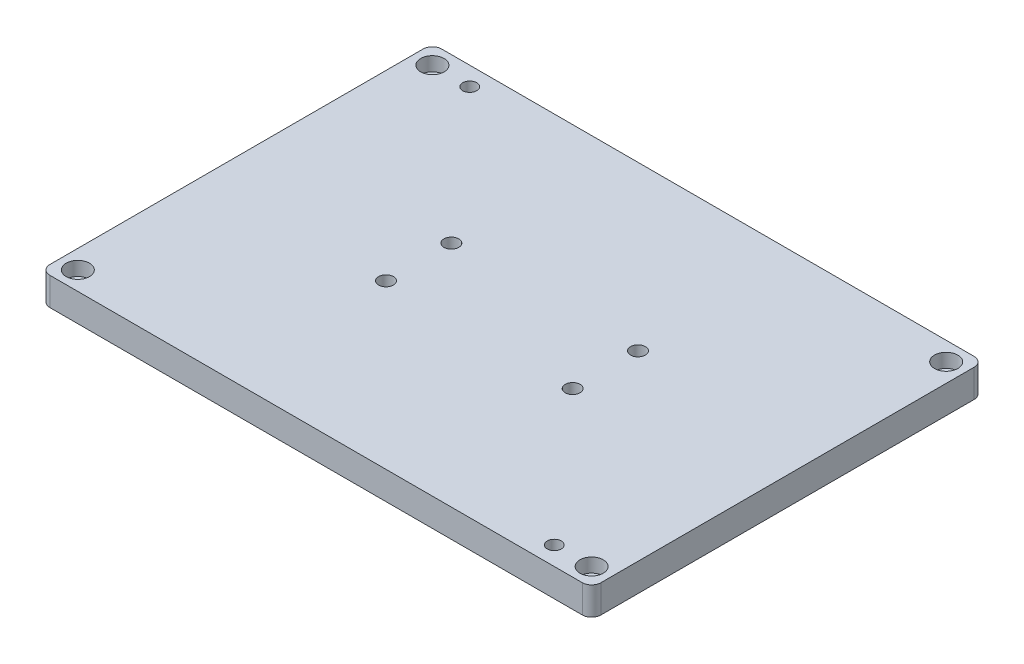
ISO-10303-21;
HEADER;
FILE_DESCRIPTION(('STEP AP214'),'2;1');
FILE_NAME('part.step','',(''),(''),'','','');
FILE_SCHEMA(('AUTOMOTIVE_DESIGN { 1 0 10303 214 1 1 1 1 }'));
ENDSEC;
DATA;
#1=APPLICATION_CONTEXT('core data for automotive mechanical design processes');
#2=APPLICATION_PROTOCOL_DEFINITION('international standard','automotive_design',2000,#1);
#3=PRODUCT_CONTEXT('',#1,'mechanical');
#4=PRODUCT('Part','Part','',(#3));
#5=PRODUCT_RELATED_PRODUCT_CATEGORY('part','',(#4));
#6=PRODUCT_DEFINITION_FORMATION('','',#4);
#7=PRODUCT_DEFINITION_CONTEXT('part definition',#1,'design');
#8=PRODUCT_DEFINITION('design','',#6,#7);
#9=PRODUCT_DEFINITION_SHAPE('','',#8);
#10=(LENGTH_UNIT() NAMED_UNIT(*) SI_UNIT(.MILLI.,.METRE.));
#11=(NAMED_UNIT(*) PLANE_ANGLE_UNIT() SI_UNIT($,.RADIAN.));
#12=(NAMED_UNIT(*) SI_UNIT($,.STERADIAN.) SOLID_ANGLE_UNIT());
#13=UNCERTAINTY_MEASURE_WITH_UNIT(LENGTH_MEASURE(1.E-05),#10,'distance_accuracy_value','');
#14=(GEOMETRIC_REPRESENTATION_CONTEXT(3) GLOBAL_UNCERTAINTY_ASSIGNED_CONTEXT((#13)) GLOBAL_UNIT_ASSIGNED_CONTEXT((#10,
#11,#12)) REPRESENTATION_CONTEXT('',''));
#15=CARTESIAN_POINT('',(0.,0.,0.));
#16=DIRECTION('',(0.,0.,1.));
#17=DIRECTION('',(1.,0.,0.));
#18=AXIS2_PLACEMENT_3D('',#15,#16,#17);
#19=CARTESIAN_POINT('',(0.,0.,0.));
#20=DIRECTION('',(0.,1.,0.));
#21=DIRECTION('',(0.,0.,1.));
#22=AXIS2_PLACEMENT_3D('',#19,#20,#21);
#23=PLANE('',#22);
#24=CARTESIAN_POINT('',(-63.5,0.,22.225));
#25=DIRECTION('',(0.,-1.,0.));
#26=DIRECTION('',(0.,0.,-1.));
#27=AXIS2_PLACEMENT_3D('',#24,#25,#26);
#28=CIRCLE('',#27,7.9375);
#29=CARTESIAN_POINT('',(-63.5,0.,14.2875));
#30=VERTEX_POINT('',#29);
#31=EDGE_CURVE('E287',#30,#30,#28,.T.);
#32=ORIENTED_EDGE('',*,*,#31,.F.);
#33=EDGE_LOOP('',(#32));
#34=FACE_BOUND('',#33,.T.);
#35=CARTESIAN_POINT('',(-63.5,0.,-22.225));
#36=DIRECTION('',(0.,-1.,0.));
#37=DIRECTION('',(0.,0.,-1.));
#38=AXIS2_PLACEMENT_3D('',#35,#36,#37);
#39=CIRCLE('',#38,7.9375);
#40=CARTESIAN_POINT('',(-63.5,0.,-30.1625));
#41=VERTEX_POINT('',#40);
#42=EDGE_CURVE('E275',#41,#41,#39,.T.);
#43=ORIENTED_EDGE('',*,*,#42,.F.);
#44=EDGE_LOOP('',(#43));
#45=FACE_BOUND('',#44,.T.);
#46=CARTESIAN_POINT('',(149.4234375,0.,120.65));
#47=DIRECTION('',(0.,1.,0.));
#48=DIRECTION('',(0.,0.,1.));
#49=AXIS2_PLACEMENT_3D('',#46,#47,#48);
#50=CIRCLE('',#49,4.7625);
#51=CARTESIAN_POINT('',(149.4234375,0.,125.4125));
#52=VERTEX_POINT('',#51);
#53=EDGE_CURVE('E236',#52,#52,#50,.T.);
#54=ORIENTED_EDGE('',*,*,#53,.T.);
#55=EDGE_LOOP('',(#54));
#56=FACE_BOUND('',#55,.T.);
#57=CARTESIAN_POINT('',(-149.4234375,0.,-120.65));
#58=DIRECTION('',(0.,1.,0.));
#59=DIRECTION('',(0.,0.,1.));
#60=AXIS2_PLACEMENT_3D('',#57,#58,#59);
#61=CIRCLE('',#60,4.7625);
#62=CARTESIAN_POINT('',(-149.4234375,0.,-115.8875));
#63=VERTEX_POINT('',#62);
#64=EDGE_CURVE('E230',#63,#63,#61,.T.);
#65=ORIENTED_EDGE('',*,*,#64,.T.);
#66=EDGE_LOOP('',(#65));
#67=FACE_BOUND('',#66,.T.);
#68=CARTESIAN_POINT('',(174.8234375,0.,120.65));
#69=DIRECTION('',(0.,1.,0.));
#70=DIRECTION('',(0.,0.,1.));
#71=AXIS2_PLACEMENT_3D('',#68,#69,#70);
#72=CIRCLE('',#71,5.04189999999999);
#73=CARTESIAN_POINT('',(174.8234375,0.,125.6919));
#74=VERTEX_POINT('',#73);
#75=EDGE_CURVE('E218',#74,#74,#72,.T.);
#76=ORIENTED_EDGE('',*,*,#75,.T.);
#77=EDGE_LOOP('',(#76));
#78=FACE_BOUND('',#77,.T.);
#79=CARTESIAN_POINT('',(174.8234375,0.,-120.65));
#80=DIRECTION('',(0.,1.,0.));
#81=DIRECTION('',(0.,0.,1.));
#82=AXIS2_PLACEMENT_3D('',#79,#80,#81);
#83=CIRCLE('',#82,5.04189999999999);
#84=CARTESIAN_POINT('',(174.8234375,0.,-115.6081));
#85=VERTEX_POINT('',#84);
#86=EDGE_CURVE('E206',#85,#85,#83,.T.);
#87=ORIENTED_EDGE('',*,*,#86,.T.);
#88=EDGE_LOOP('',(#87));
#89=FACE_BOUND('',#88,.T.);
#90=CARTESIAN_POINT('',(-174.8234375,0.,120.65));
#91=DIRECTION('',(0.,1.,0.));
#92=DIRECTION('',(0.,0.,1.));
#93=AXIS2_PLACEMENT_3D('',#90,#91,#92);
#94=CIRCLE('',#93,5.04189999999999);
#95=CARTESIAN_POINT('',(-174.8234375,0.,125.6919));
#96=VERTEX_POINT('',#95);
#97=EDGE_CURVE('E194',#96,#96,#94,.T.);
#98=ORIENTED_EDGE('',*,*,#97,.T.);
#99=EDGE_LOOP('',(#98));
#100=FACE_BOUND('',#99,.T.);
#101=CARTESIAN_POINT('',(-174.8234375,0.,-120.65));
#102=DIRECTION('',(0.,1.,0.));
#103=DIRECTION('',(0.,0.,1.));
#104=AXIS2_PLACEMENT_3D('',#101,#102,#103);
#105=CIRCLE('',#104,5.04189999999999);
#106=CARTESIAN_POINT('',(-174.8234375,0.,-115.6081));
#107=VERTEX_POINT('',#106);
#108=EDGE_CURVE('E129',#107,#107,#105,.T.);
#109=ORIENTED_EDGE('',*,*,#108,.T.);
#110=EDGE_LOOP('',(#109));
#111=FACE_BOUND('',#110,.T.);
#112=DIRECTION('',(0.,0.,-1.));
#113=VECTOR('',#112,1.);
#114=CARTESIAN_POINT('',(187.5234375,0.,-133.35));
#115=LINE('',#114,#113);
#116=CARTESIAN_POINT('',(187.5234375,0.,127.));
#117=VERTEX_POINT('',#116);
#118=CARTESIAN_POINT('',(187.5234375,0.,-127.));
#119=VERTEX_POINT('',#118);
#120=EDGE_CURVE('E118',#117,#119,#115,.T.);
#121=ORIENTED_EDGE('',*,*,#120,.F.);
#122=CARTESIAN_POINT('',(181.1734375,0.,127.));
#123=DIRECTION('',(0.,1.,0.));
#124=DIRECTION('',(0.,0.,1.));
#125=AXIS2_PLACEMENT_3D('',#122,#123,#124);
#126=CIRCLE('',#125,6.35);
#127=CARTESIAN_POINT('',(181.1734375,0.,133.35));
#128=VERTEX_POINT('',#127);
#129=EDGE_CURVE('E101',#117,#128,#126,.F.);
#130=ORIENTED_EDGE('',*,*,#129,.T.);
#131=DIRECTION('',(1.,0.,0.));
#132=VECTOR('',#131,1.);
#133=CARTESIAN_POINT('',(-187.5234375,0.,133.35));
#134=LINE('',#133,#132);
#135=CARTESIAN_POINT('',(-181.1734375,0.,133.35));
#136=VERTEX_POINT('',#135);
#137=EDGE_CURVE('E142',#136,#128,#134,.T.);
#138=ORIENTED_EDGE('',*,*,#137,.F.);
#139=CARTESIAN_POINT('',(-181.1734375,0.,127.));
#140=DIRECTION('',(0.,1.,0.));
#141=DIRECTION('',(0.,0.,1.));
#142=AXIS2_PLACEMENT_3D('',#139,#140,#141);
#143=CIRCLE('',#142,6.35);
#144=CARTESIAN_POINT('',(-187.5234375,0.,127.));
#145=VERTEX_POINT('',#144);
#146=EDGE_CURVE('E112',#136,#145,#143,.F.);
#147=ORIENTED_EDGE('',*,*,#146,.T.);
#148=DIRECTION('',(0.,0.,1.));
#149=VECTOR('',#148,1.);
#150=CARTESIAN_POINT('',(-187.5234375,0.,-133.35));
#151=LINE('',#150,#149);
#152=CARTESIAN_POINT('',(-187.5234375,0.,-127.));
#153=VERTEX_POINT('',#152);
#154=EDGE_CURVE('E132',#153,#145,#151,.T.);
#155=ORIENTED_EDGE('',*,*,#154,.F.);
#156=CARTESIAN_POINT('',(-181.1734375,0.,-127.));
#157=DIRECTION('',(0.,1.,0.));
#158=DIRECTION('',(0.,0.,1.));
#159=AXIS2_PLACEMENT_3D('',#156,#157,#158);
#160=CIRCLE('',#159,6.35);
#161=CARTESIAN_POINT('',(-181.1734375,0.,-133.35));
#162=VERTEX_POINT('',#161);
#163=EDGE_CURVE('E122',#153,#162,#160,.F.);
#164=ORIENTED_EDGE('',*,*,#163,.T.);
#165=DIRECTION('',(-1.,0.,0.));
#166=VECTOR('',#165,1.);
#167=CARTESIAN_POINT('',(-187.5234375,0.,-133.35));
#168=LINE('',#167,#166);
#169=CARTESIAN_POINT('',(181.1734375,0.,-133.35));
#170=VERTEX_POINT('',#169);
#171=EDGE_CURVE('E128',#170,#162,#168,.T.);
#172=ORIENTED_EDGE('',*,*,#171,.F.);
#173=CARTESIAN_POINT('',(181.1734375,0.,-127.));
#174=DIRECTION('',(0.,1.,0.));
#175=DIRECTION('',(0.,0.,1.));
#176=AXIS2_PLACEMENT_3D('',#173,#174,#175);
#177=CIRCLE('',#176,6.35);
#178=EDGE_CURVE('E127',#170,#119,#177,.F.);
#179=ORIENTED_EDGE('',*,*,#178,.T.);
#180=EDGE_LOOP('',(#121,#130,#138,#147,#155,#164,#172,#179));
#181=FACE_BOUND('',#180,.T.);
#182=CARTESIAN_POINT('',(63.5,0.,-22.225));
#183=DIRECTION('',(0.,-1.,0.));
#184=DIRECTION('',(0.,0.,-1.));
#185=AXIS2_PLACEMENT_3D('',#182,#183,#184);
#186=CIRCLE('',#185,7.9375);
#187=CARTESIAN_POINT('',(63.5,0.,-30.1625));
#188=VERTEX_POINT('',#187);
#189=EDGE_CURVE('E251',#188,#188,#186,.T.);
#190=ORIENTED_EDGE('',*,*,#189,.F.);
#191=EDGE_LOOP('',(#190));
#192=FACE_BOUND('',#191,.T.);
#193=CARTESIAN_POINT('',(63.5,0.,22.225));
#194=DIRECTION('',(0.,-1.,0.));
#195=DIRECTION('',(0.,0.,-1.));
#196=AXIS2_PLACEMENT_3D('',#193,#194,#195);
#197=CIRCLE('',#196,7.9375);
#198=CARTESIAN_POINT('',(63.5,0.,14.2875));
#199=VERTEX_POINT('',#198);
#200=EDGE_CURVE('E263',#199,#199,#197,.T.);
#201=ORIENTED_EDGE('',*,*,#200,.F.);
#202=EDGE_LOOP('',(#201));
#203=FACE_BOUND('',#202,.T.);
#204=ADVANCED_FACE('F34',(#34,#45,#56,#67,#78,#89,#100,#111,#181,#192,#203),#23,.F.);
#205=CARTESIAN_POINT('',(0.,19.05,0.));
#206=DIRECTION('',(0.,1.,0.));
#207=DIRECTION('',(0.,0.,1.));
#208=AXIS2_PLACEMENT_3D('',#205,#206,#207);
#209=PLANE('',#208);
#210=CARTESIAN_POINT('',(-63.5,19.05,22.225));
#211=DIRECTION('',(0.,-1.,0.));
#212=DIRECTION('',(0.,0.,-1.));
#213=AXIS2_PLACEMENT_3D('',#210,#211,#212);
#214=CIRCLE('',#213,5.04189999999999);
#215=CARTESIAN_POINT('',(-63.5,19.05,17.1831));
#216=VERTEX_POINT('',#215);
#217=EDGE_CURVE('E278',#216,#216,#214,.T.);
#218=ORIENTED_EDGE('',*,*,#217,.T.);
#219=EDGE_LOOP('',(#218));
#220=FACE_BOUND('',#219,.T.);
#221=CARTESIAN_POINT('',(-63.5,19.05,-22.225));
#222=DIRECTION('',(0.,-1.,0.));
#223=DIRECTION('',(0.,0.,-1.));
#224=AXIS2_PLACEMENT_3D('',#221,#222,#223);
#225=CIRCLE('',#224,5.04189999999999);
#226=CARTESIAN_POINT('',(-63.5,19.05,-27.2669));
#227=VERTEX_POINT('',#226);
#228=EDGE_CURVE('E266',#227,#227,#225,.T.);
#229=ORIENTED_EDGE('',*,*,#228,.T.);
#230=EDGE_LOOP('',(#229));
#231=FACE_BOUND('',#230,.T.);
#232=CARTESIAN_POINT('',(63.5,19.05,22.225));
#233=DIRECTION('',(0.,-1.,0.));
#234=DIRECTION('',(0.,0.,-1.));
#235=AXIS2_PLACEMENT_3D('',#232,#233,#234);
#236=CIRCLE('',#235,5.0419);
#237=CARTESIAN_POINT('',(63.5,19.05,17.1831));
#238=VERTEX_POINT('',#237);
#239=EDGE_CURVE('E254',#238,#238,#236,.T.);
#240=ORIENTED_EDGE('',*,*,#239,.T.);
#241=EDGE_LOOP('',(#240));
#242=FACE_BOUND('',#241,.T.);
#243=DIRECTION('',(1.,0.,0.));
#244=VECTOR('',#243,1.);
#245=CARTESIAN_POINT('',(-187.5234375,19.05,133.35));
#246=LINE('',#245,#244);
#247=CARTESIAN_POINT('',(-181.1734375,19.05,133.35));
#248=VERTEX_POINT('',#247);
#249=CARTESIAN_POINT('',(181.1734375,19.05,133.35));
#250=VERTEX_POINT('',#249);
#251=EDGE_CURVE('E138',#248,#250,#246,.T.);
#252=ORIENTED_EDGE('',*,*,#251,.T.);
#253=CARTESIAN_POINT('',(181.1734375,19.05,127.));
#254=DIRECTION('',(0.,1.,0.));
#255=DIRECTION('',(0.,0.,1.));
#256=AXIS2_PLACEMENT_3D('',#253,#254,#255);
#257=CIRCLE('',#256,6.35);
#258=CARTESIAN_POINT('',(187.5234375,19.05,127.));
#259=VERTEX_POINT('',#258);
#260=EDGE_CURVE('E156',#250,#259,#257,.T.);
#261=ORIENTED_EDGE('',*,*,#260,.T.);
#262=DIRECTION('',(0.,0.,-1.));
#263=VECTOR('',#262,1.);
#264=CARTESIAN_POINT('',(187.5234375,19.05,-133.35));
#265=LINE('',#264,#263);
#266=CARTESIAN_POINT('',(187.5234375,19.05,-127.));
#267=VERTEX_POINT('',#266);
#268=EDGE_CURVE('E121',#259,#267,#265,.T.);
#269=ORIENTED_EDGE('',*,*,#268,.T.);
#270=CARTESIAN_POINT('',(181.1734375,19.05,-127.));
#271=DIRECTION('',(0.,1.,0.));
#272=DIRECTION('',(0.,0.,1.));
#273=AXIS2_PLACEMENT_3D('',#270,#271,#272);
#274=CIRCLE('',#273,6.35);
#275=CARTESIAN_POINT('',(181.1734375,19.05,-133.35));
#276=VERTEX_POINT('',#275);
#277=EDGE_CURVE('E152',#267,#276,#274,.T.);
#278=ORIENTED_EDGE('',*,*,#277,.T.);
#279=DIRECTION('',(-1.,0.,0.));
#280=VECTOR('',#279,1.);
#281=CARTESIAN_POINT('',(-187.5234375,19.05,-133.35));
#282=LINE('',#281,#280);
#283=CARTESIAN_POINT('',(-181.1734375,19.05,-133.35));
#284=VERTEX_POINT('',#283);
#285=EDGE_CURVE('E165',#276,#284,#282,.T.);
#286=ORIENTED_EDGE('',*,*,#285,.T.);
#287=CARTESIAN_POINT('',(-181.1734375,19.05,-127.));
#288=DIRECTION('',(0.,1.,0.));
#289=DIRECTION('',(0.,0.,1.));
#290=AXIS2_PLACEMENT_3D('',#287,#288,#289);
#291=CIRCLE('',#290,6.35);
#292=CARTESIAN_POINT('',(-187.5234375,19.05,-127.));
#293=VERTEX_POINT('',#292);
#294=EDGE_CURVE('E56',#284,#293,#291,.T.);
#295=ORIENTED_EDGE('',*,*,#294,.T.);
#296=DIRECTION('',(0.,0.,1.));
#297=VECTOR('',#296,1.);
#298=CARTESIAN_POINT('',(-187.5234375,19.05,-133.35));
#299=LINE('',#298,#297);
#300=CARTESIAN_POINT('',(-187.5234375,19.05,127.));
#301=VERTEX_POINT('',#300);
#302=EDGE_CURVE('E172',#293,#301,#299,.T.);
#303=ORIENTED_EDGE('',*,*,#302,.T.);
#304=CARTESIAN_POINT('',(-181.1734375,19.05,127.));
#305=DIRECTION('',(0.,1.,0.));
#306=DIRECTION('',(0.,0.,1.));
#307=AXIS2_PLACEMENT_3D('',#304,#305,#306);
#308=CIRCLE('',#307,6.35);
#309=EDGE_CURVE('E154',#301,#248,#308,.T.);
#310=ORIENTED_EDGE('',*,*,#309,.T.);
#311=EDGE_LOOP('',(#252,#261,#269,#278,#286,#295,#303,#310));
#312=FACE_BOUND('',#311,.T.);
#313=CARTESIAN_POINT('',(-174.8234375,19.05,-120.65));
#314=DIRECTION('',(0.,1.,0.));
#315=DIRECTION('',(0.,0.,1.));
#316=AXIS2_PLACEMENT_3D('',#313,#314,#315);
#317=CIRCLE('',#316,7.93749999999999);
#318=CARTESIAN_POINT('',(-174.8234375,19.05,-112.7125));
#319=VERTEX_POINT('',#318);
#320=EDGE_CURVE('E191',#319,#319,#317,.T.);
#321=ORIENTED_EDGE('',*,*,#320,.F.);
#322=EDGE_LOOP('',(#321));
#323=FACE_BOUND('',#322,.T.);
#324=CARTESIAN_POINT('',(-174.8234375,19.05,120.65));
#325=DIRECTION('',(0.,1.,0.));
#326=DIRECTION('',(0.,0.,1.));
#327=AXIS2_PLACEMENT_3D('',#324,#325,#326);
#328=CIRCLE('',#327,7.93749999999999);
#329=CARTESIAN_POINT('',(-174.8234375,19.05,128.5875));
#330=VERTEX_POINT('',#329);
#331=EDGE_CURVE('E203',#330,#330,#328,.T.);
#332=ORIENTED_EDGE('',*,*,#331,.F.);
#333=EDGE_LOOP('',(#332));
#334=FACE_BOUND('',#333,.T.);
#335=CARTESIAN_POINT('',(174.8234375,19.05,-120.65));
#336=DIRECTION('',(0.,1.,0.));
#337=DIRECTION('',(0.,0.,1.));
#338=AXIS2_PLACEMENT_3D('',#335,#336,#337);
#339=CIRCLE('',#338,7.93749999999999);
#340=CARTESIAN_POINT('',(174.8234375,19.05,-112.7125));
#341=VERTEX_POINT('',#340);
#342=EDGE_CURVE('E215',#341,#341,#339,.T.);
#343=ORIENTED_EDGE('',*,*,#342,.F.);
#344=EDGE_LOOP('',(#343));
#345=FACE_BOUND('',#344,.T.);
#346=CARTESIAN_POINT('',(174.8234375,19.05,120.65));
#347=DIRECTION('',(0.,1.,0.));
#348=DIRECTION('',(0.,0.,1.));
#349=AXIS2_PLACEMENT_3D('',#346,#347,#348);
#350=CIRCLE('',#349,7.93749999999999);
#351=CARTESIAN_POINT('',(174.8234375,19.05,128.5875));
#352=VERTEX_POINT('',#351);
#353=EDGE_CURVE('E227',#352,#352,#350,.T.);
#354=ORIENTED_EDGE('',*,*,#353,.F.);
#355=EDGE_LOOP('',(#354));
#356=FACE_BOUND('',#355,.T.);
#357=CARTESIAN_POINT('',(-149.4234375,19.05,-120.65));
#358=DIRECTION('',(0.,1.,0.));
#359=DIRECTION('',(0.,0.,1.));
#360=AXIS2_PLACEMENT_3D('',#357,#358,#359);
#361=CIRCLE('',#360,4.7625);
#362=CARTESIAN_POINT('',(-149.4234375,19.05,-115.8875));
#363=VERTEX_POINT('',#362);
#364=EDGE_CURVE('E233',#363,#363,#361,.T.);
#365=ORIENTED_EDGE('',*,*,#364,.F.);
#366=EDGE_LOOP('',(#365));
#367=FACE_BOUND('',#366,.T.);
#368=CARTESIAN_POINT('',(149.4234375,19.05,120.65));
#369=DIRECTION('',(0.,1.,0.));
#370=DIRECTION('',(0.,0.,1.));
#371=AXIS2_PLACEMENT_3D('',#368,#369,#370);
#372=CIRCLE('',#371,4.7625);
#373=CARTESIAN_POINT('',(149.4234375,19.05,125.4125));
#374=VERTEX_POINT('',#373);
#375=EDGE_CURVE('E239',#374,#374,#372,.T.);
#376=ORIENTED_EDGE('',*,*,#375,.F.);
#377=EDGE_LOOP('',(#376));
#378=FACE_BOUND('',#377,.T.);
#379=CARTESIAN_POINT('',(63.5,19.05,-22.225));
#380=DIRECTION('',(0.,-1.,0.));
#381=DIRECTION('',(0.,0.,-1.));
#382=AXIS2_PLACEMENT_3D('',#379,#380,#381);
#383=CIRCLE('',#382,5.0419);
#384=CARTESIAN_POINT('',(63.5,19.05,-27.2669));
#385=VERTEX_POINT('',#384);
#386=EDGE_CURVE('E242',#385,#385,#383,.T.);
#387=ORIENTED_EDGE('',*,*,#386,.T.);
#388=EDGE_LOOP('',(#387));
#389=FACE_BOUND('',#388,.T.);
#390=ADVANCED_FACE('F169',(#220,#231,#242,#312,#323,#334,#345,#356,#367,#378,#389),#209,.T.);
#391=CARTESIAN_POINT('',(187.5234375,19.05,-133.35));
#392=DIRECTION('',(-1.,0.,0.));
#393=DIRECTION('',(0.,0.,1.));
#394=AXIS2_PLACEMENT_3D('',#391,#392,#393);
#395=PLANE('',#394);
#396=ORIENTED_EDGE('',*,*,#268,.F.);
#397=DIRECTION('',(0.,-1.,0.));
#398=VECTOR('',#397,1.);
#399=CARTESIAN_POINT('',(187.5234375,19.05,127.));
#400=LINE('',#399,#398);
#401=EDGE_CURVE('E105',#259,#117,#400,.T.);
#402=ORIENTED_EDGE('',*,*,#401,.T.);
#403=ORIENTED_EDGE('',*,*,#120,.T.);
#404=DIRECTION('',(0.,-1.,0.));
#405=VECTOR('',#404,1.);
#406=CARTESIAN_POINT('',(187.5234375,19.05,-127.));
#407=LINE('',#406,#405);
#408=EDGE_CURVE('E123',#119,#267,#407,.F.);
#409=ORIENTED_EDGE('',*,*,#408,.T.);
#410=EDGE_LOOP('',(#396,#402,#403,#409));
#411=FACE_BOUND('',#410,.T.);
#412=ADVANCED_FACE('F117',(#411),#395,.F.);
#413=CARTESIAN_POINT('',(-187.5234375,19.05,-133.35));
#414=DIRECTION('',(0.,0.,1.));
#415=DIRECTION('',(1.,0.,0.));
#416=AXIS2_PLACEMENT_3D('',#413,#414,#415);
#417=PLANE('',#416);
#418=ORIENTED_EDGE('',*,*,#285,.F.);
#419=DIRECTION('',(0.,-1.,0.));
#420=VECTOR('',#419,1.);
#421=CARTESIAN_POINT('',(181.1734375,19.05,-133.35));
#422=LINE('',#421,#420);
#423=EDGE_CURVE('E11',#276,#170,#422,.T.);
#424=ORIENTED_EDGE('',*,*,#423,.T.);
#425=ORIENTED_EDGE('',*,*,#171,.T.);
#426=DIRECTION('',(0.,-1.,0.));
#427=VECTOR('',#426,1.);
#428=CARTESIAN_POINT('',(-181.1734375,19.05,-133.35));
#429=LINE('',#428,#427);
#430=EDGE_CURVE('E42',#162,#284,#429,.F.);
#431=ORIENTED_EDGE('',*,*,#430,.T.);
#432=EDGE_LOOP('',(#418,#424,#425,#431));
#433=FACE_BOUND('',#432,.T.);
#434=ADVANCED_FACE('F164',(#433),#417,.F.);
#435=CARTESIAN_POINT('',(-187.5234375,19.05,-133.35));
#436=DIRECTION('',(1.,0.,0.));
#437=DIRECTION('',(0.,0.,-1.));
#438=AXIS2_PLACEMENT_3D('',#435,#436,#437);
#439=PLANE('',#438);
#440=ORIENTED_EDGE('',*,*,#154,.T.);
#441=DIRECTION('',(0.,-1.,0.));
#442=VECTOR('',#441,1.);
#443=CARTESIAN_POINT('',(-187.5234375,19.05,127.));
#444=LINE('',#443,#442);
#445=EDGE_CURVE('E49',#145,#301,#444,.F.);
#446=ORIENTED_EDGE('',*,*,#445,.T.);
#447=ORIENTED_EDGE('',*,*,#302,.F.);
#448=DIRECTION('',(0.,-1.,0.));
#449=VECTOR('',#448,1.);
#450=CARTESIAN_POINT('',(-187.5234375,19.05,-127.));
#451=LINE('',#450,#449);
#452=EDGE_CURVE('E158',#293,#153,#451,.T.);
#453=ORIENTED_EDGE('',*,*,#452,.T.);
#454=EDGE_LOOP('',(#440,#446,#447,#453));
#455=FACE_BOUND('',#454,.T.);
#456=ADVANCED_FACE('F176',(#455),#439,.F.);
#457=CARTESIAN_POINT('',(-187.5234375,19.05,133.35));
#458=DIRECTION('',(0.,0.,-1.));
#459=DIRECTION('',(-1.,0.,0.));
#460=AXIS2_PLACEMENT_3D('',#457,#458,#459);
#461=PLANE('',#460);
#462=ORIENTED_EDGE('',*,*,#137,.T.);
#463=DIRECTION('',(0.,-1.,0.));
#464=VECTOR('',#463,1.);
#465=CARTESIAN_POINT('',(181.1734375,19.05,133.35));
#466=LINE('',#465,#464);
#467=EDGE_CURVE('E106',#128,#250,#466,.F.);
#468=ORIENTED_EDGE('',*,*,#467,.T.);
#469=ORIENTED_EDGE('',*,*,#251,.F.);
#470=DIRECTION('',(0.,-1.,0.));
#471=VECTOR('',#470,1.);
#472=CARTESIAN_POINT('',(-181.1734375,19.05,133.35));
#473=LINE('',#472,#471);
#474=EDGE_CURVE('E111',#248,#136,#473,.T.);
#475=ORIENTED_EDGE('',*,*,#474,.T.);
#476=EDGE_LOOP('',(#462,#468,#469,#475));
#477=FACE_BOUND('',#476,.T.);
#478=ADVANCED_FACE('F183',(#477),#461,.F.);
#479=CARTESIAN_POINT('',(-174.8234375,19.05,-120.65));
#480=DIRECTION('',(0.,1.,0.));
#481=DIRECTION('',(0.,0.,1.));
#482=AXIS2_PLACEMENT_3D('',#479,#480,#481);
#483=CYLINDRICAL_SURFACE('',#482,5.04189999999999);
#484=ORIENTED_EDGE('',*,*,#108,.F.);
#485=EDGE_LOOP('',(#484));
#486=FACE_BOUND('',#485,.T.);
#487=CARTESIAN_POINT('',(-174.8234375,9.525,-120.65));
#488=DIRECTION('',(0.,1.,0.));
#489=DIRECTION('',(0.,0.,1.));
#490=AXIS2_PLACEMENT_3D('',#487,#488,#489);
#491=CIRCLE('',#490,5.04189999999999);
#492=CARTESIAN_POINT('',(-174.8234375,9.525,-115.6081));
#493=VERTEX_POINT('',#492);
#494=EDGE_CURVE('E135',#493,#493,#491,.T.);
#495=ORIENTED_EDGE('',*,*,#494,.T.);
#496=EDGE_LOOP('',(#495));
#497=FACE_BOUND('',#496,.T.);
#498=ADVANCED_FACE('F310',(#486,#497),#483,.F.);
#499=CARTESIAN_POINT('',(-169.7815375,9.525,-120.65));
#500=DIRECTION('',(0.,-1.,0.));
#501=DIRECTION('',(0.,0.,-1.));
#502=AXIS2_PLACEMENT_3D('',#499,#500,#501);
#503=PLANE('',#502);
#504=ORIENTED_EDGE('',*,*,#494,.F.);
#505=EDGE_LOOP('',(#504));
#506=FACE_BOUND('',#505,.T.);
#507=CARTESIAN_POINT('',(-174.8234375,9.525,-120.65));
#508=DIRECTION('',(0.,1.,0.));
#509=DIRECTION('',(0.,0.,1.));
#510=AXIS2_PLACEMENT_3D('',#507,#508,#509);
#511=CIRCLE('',#510,7.93749999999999);
#512=CARTESIAN_POINT('',(-174.8234375,9.525,-112.7125));
#513=VERTEX_POINT('',#512);
#514=EDGE_CURVE('E188',#513,#513,#511,.T.);
#515=ORIENTED_EDGE('',*,*,#514,.T.);
#516=EDGE_LOOP('',(#515));
#517=FACE_BOUND('',#516,.T.);
#518=ADVANCED_FACE('F313',(#506,#517),#503,.F.);
#519=CARTESIAN_POINT('',(-174.8234375,19.05,-120.65));
#520=DIRECTION('',(0.,1.,0.));
#521=DIRECTION('',(0.,0.,1.));
#522=AXIS2_PLACEMENT_3D('',#519,#520,#521);
#523=CYLINDRICAL_SURFACE('',#522,7.93749999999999);
#524=ORIENTED_EDGE('',*,*,#514,.F.);
#525=EDGE_LOOP('',(#524));
#526=FACE_BOUND('',#525,.T.);
#527=ORIENTED_EDGE('',*,*,#320,.T.);
#528=EDGE_LOOP('',(#527));
#529=FACE_BOUND('',#528,.T.);
#530=ADVANCED_FACE('F319',(#526,#529),#523,.F.);
#531=CARTESIAN_POINT('',(-174.8234375,19.05,120.65));
#532=DIRECTION('',(0.,1.,0.));
#533=DIRECTION('',(0.,0.,1.));
#534=AXIS2_PLACEMENT_3D('',#531,#532,#533);
#535=CYLINDRICAL_SURFACE('',#534,5.04189999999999);
#536=ORIENTED_EDGE('',*,*,#97,.F.);
#537=EDGE_LOOP('',(#536));
#538=FACE_BOUND('',#537,.T.);
#539=CARTESIAN_POINT('',(-174.8234375,9.525,120.65));
#540=DIRECTION('',(0.,1.,0.));
#541=DIRECTION('',(0.,0.,1.));
#542=AXIS2_PLACEMENT_3D('',#539,#540,#541);
#543=CIRCLE('',#542,5.04189999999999);
#544=CARTESIAN_POINT('',(-174.8234375,9.525,125.6919));
#545=VERTEX_POINT('',#544);
#546=EDGE_CURVE('E197',#545,#545,#543,.T.);
#547=ORIENTED_EDGE('',*,*,#546,.T.);
#548=EDGE_LOOP('',(#547));
#549=FACE_BOUND('',#548,.T.);
#550=ADVANCED_FACE('F325',(#538,#549),#535,.F.);
#551=CARTESIAN_POINT('',(-169.7815375,9.525,120.65));
#552=DIRECTION('',(0.,-1.,0.));
#553=DIRECTION('',(0.,0.,-1.));
#554=AXIS2_PLACEMENT_3D('',#551,#552,#553);
#555=PLANE('',#554);
#556=ORIENTED_EDGE('',*,*,#546,.F.);
#557=EDGE_LOOP('',(#556));
#558=FACE_BOUND('',#557,.T.);
#559=CARTESIAN_POINT('',(-174.8234375,9.525,120.65));
#560=DIRECTION('',(0.,1.,0.));
#561=DIRECTION('',(0.,0.,1.));
#562=AXIS2_PLACEMENT_3D('',#559,#560,#561);
#563=CIRCLE('',#562,7.93749999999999);
#564=CARTESIAN_POINT('',(-174.8234375,9.525,128.5875));
#565=VERTEX_POINT('',#564);
#566=EDGE_CURVE('E200',#565,#565,#563,.T.);
#567=ORIENTED_EDGE('',*,*,#566,.T.);
#568=EDGE_LOOP('',(#567));
#569=FACE_BOUND('',#568,.T.);
#570=ADVANCED_FACE('F421',(#558,#569),#555,.F.);
#571=CARTESIAN_POINT('',(-174.8234375,19.05,120.65));
#572=DIRECTION('',(0.,1.,0.));
#573=DIRECTION('',(0.,0.,1.));
#574=AXIS2_PLACEMENT_3D('',#571,#572,#573);
#575=CYLINDRICAL_SURFACE('',#574,7.93749999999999);
#576=ORIENTED_EDGE('',*,*,#566,.F.);
#577=EDGE_LOOP('',(#576));
#578=FACE_BOUND('',#577,.T.);
#579=ORIENTED_EDGE('',*,*,#331,.T.);
#580=EDGE_LOOP('',(#579));
#581=FACE_BOUND('',#580,.T.);
#582=ADVANCED_FACE('F417',(#578,#581),#575,.F.);
#583=CARTESIAN_POINT('',(174.8234375,19.05,-120.65));
#584=DIRECTION('',(0.,1.,0.));
#585=DIRECTION('',(0.,0.,1.));
#586=AXIS2_PLACEMENT_3D('',#583,#584,#585);
#587=CYLINDRICAL_SURFACE('',#586,5.04189999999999);
#588=ORIENTED_EDGE('',*,*,#86,.F.);
#589=EDGE_LOOP('',(#588));
#590=FACE_BOUND('',#589,.T.);
#591=CARTESIAN_POINT('',(174.8234375,9.525,-120.65));
#592=DIRECTION('',(0.,1.,0.));
#593=DIRECTION('',(0.,0.,1.));
#594=AXIS2_PLACEMENT_3D('',#591,#592,#593);
#595=CIRCLE('',#594,5.04189999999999);
#596=CARTESIAN_POINT('',(174.8234375,9.525,-115.6081));
#597=VERTEX_POINT('',#596);
#598=EDGE_CURVE('E209',#597,#597,#595,.T.);
#599=ORIENTED_EDGE('',*,*,#598,.T.);
#600=EDGE_LOOP('',(#599));
#601=FACE_BOUND('',#600,.T.);
#602=ADVANCED_FACE('F413',(#590,#601),#587,.F.);
#603=CARTESIAN_POINT('',(179.8653375,9.525,-120.65));
#604=DIRECTION('',(0.,-1.,0.));
#605=DIRECTION('',(0.,0.,-1.));
#606=AXIS2_PLACEMENT_3D('',#603,#604,#605);
#607=PLANE('',#606);
#608=ORIENTED_EDGE('',*,*,#598,.F.);
#609=EDGE_LOOP('',(#608));
#610=FACE_BOUND('',#609,.T.);
#611=CARTESIAN_POINT('',(174.8234375,9.525,-120.65));
#612=DIRECTION('',(0.,1.,0.));
#613=DIRECTION('',(0.,0.,1.));
#614=AXIS2_PLACEMENT_3D('',#611,#612,#613);
#615=CIRCLE('',#614,7.93749999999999);
#616=CARTESIAN_POINT('',(174.8234375,9.525,-112.7125));
#617=VERTEX_POINT('',#616);
#618=EDGE_CURVE('E212',#617,#617,#615,.T.);
#619=ORIENTED_EDGE('',*,*,#618,.T.);
#620=EDGE_LOOP('',(#619));
#621=FACE_BOUND('',#620,.T.);
#622=ADVANCED_FACE('F409',(#610,#621),#607,.F.);
#623=CARTESIAN_POINT('',(174.8234375,19.05,-120.65));
#624=DIRECTION('',(0.,1.,0.));
#625=DIRECTION('',(0.,0.,1.));
#626=AXIS2_PLACEMENT_3D('',#623,#624,#625);
#627=CYLINDRICAL_SURFACE('',#626,7.93749999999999);
#628=ORIENTED_EDGE('',*,*,#618,.F.);
#629=EDGE_LOOP('',(#628));
#630=FACE_BOUND('',#629,.T.);
#631=ORIENTED_EDGE('',*,*,#342,.T.);
#632=EDGE_LOOP('',(#631));
#633=FACE_BOUND('',#632,.T.);
#634=ADVANCED_FACE('F405',(#630,#633),#627,.F.);
#635=CARTESIAN_POINT('',(174.8234375,19.05,120.65));
#636=DIRECTION('',(0.,1.,0.));
#637=DIRECTION('',(0.,0.,1.));
#638=AXIS2_PLACEMENT_3D('',#635,#636,#637);
#639=CYLINDRICAL_SURFACE('',#638,5.04189999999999);
#640=ORIENTED_EDGE('',*,*,#75,.F.);
#641=EDGE_LOOP('',(#640));
#642=FACE_BOUND('',#641,.T.);
#643=CARTESIAN_POINT('',(174.8234375,9.525,120.65));
#644=DIRECTION('',(0.,1.,0.));
#645=DIRECTION('',(0.,0.,1.));
#646=AXIS2_PLACEMENT_3D('',#643,#644,#645);
#647=CIRCLE('',#646,5.04189999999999);
#648=CARTESIAN_POINT('',(174.8234375,9.525,125.6919));
#649=VERTEX_POINT('',#648);
#650=EDGE_CURVE('E221',#649,#649,#647,.T.);
#651=ORIENTED_EDGE('',*,*,#650,.T.);
#652=EDGE_LOOP('',(#651));
#653=FACE_BOUND('',#652,.T.);
#654=ADVANCED_FACE('F401',(#642,#653),#639,.F.);
#655=CARTESIAN_POINT('',(179.8653375,9.525,120.65));
#656=DIRECTION('',(0.,-1.,0.));
#657=DIRECTION('',(0.,0.,-1.));
#658=AXIS2_PLACEMENT_3D('',#655,#656,#657);
#659=PLANE('',#658);
#660=ORIENTED_EDGE('',*,*,#650,.F.);
#661=EDGE_LOOP('',(#660));
#662=FACE_BOUND('',#661,.T.);
#663=CARTESIAN_POINT('',(174.8234375,9.525,120.65));
#664=DIRECTION('',(0.,1.,0.));
#665=DIRECTION('',(0.,0.,1.));
#666=AXIS2_PLACEMENT_3D('',#663,#664,#665);
#667=CIRCLE('',#666,7.93749999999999);
#668=CARTESIAN_POINT('',(174.8234375,9.525,128.5875));
#669=VERTEX_POINT('',#668);
#670=EDGE_CURVE('E224',#669,#669,#667,.T.);
#671=ORIENTED_EDGE('',*,*,#670,.T.);
#672=EDGE_LOOP('',(#671));
#673=FACE_BOUND('',#672,.T.);
#674=ADVANCED_FACE('F397',(#662,#673),#659,.F.);
#675=CARTESIAN_POINT('',(174.8234375,19.05,120.65));
#676=DIRECTION('',(0.,1.,0.));
#677=DIRECTION('',(0.,0.,1.));
#678=AXIS2_PLACEMENT_3D('',#675,#676,#677);
#679=CYLINDRICAL_SURFACE('',#678,7.93749999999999);
#680=ORIENTED_EDGE('',*,*,#670,.F.);
#681=EDGE_LOOP('',(#680));
#682=FACE_BOUND('',#681,.T.);
#683=ORIENTED_EDGE('',*,*,#353,.T.);
#684=EDGE_LOOP('',(#683));
#685=FACE_BOUND('',#684,.T.);
#686=ADVANCED_FACE('F393',(#682,#685),#679,.F.);
#687=CARTESIAN_POINT('',(-149.4234375,19.05,-120.65));
#688=DIRECTION('',(0.,1.,0.));
#689=DIRECTION('',(0.,0.,1.));
#690=AXIS2_PLACEMENT_3D('',#687,#688,#689);
#691=CYLINDRICAL_SURFACE('',#690,4.7625);
#692=ORIENTED_EDGE('',*,*,#64,.F.);
#693=EDGE_LOOP('',(#692));
#694=FACE_BOUND('',#693,.T.);
#695=ORIENTED_EDGE('',*,*,#364,.T.);
#696=EDGE_LOOP('',(#695));
#697=FACE_BOUND('',#696,.T.);
#698=ADVANCED_FACE('F389',(#694,#697),#691,.F.);
#699=CARTESIAN_POINT('',(149.4234375,19.05,120.65));
#700=DIRECTION('',(0.,1.,0.));
#701=DIRECTION('',(0.,0.,1.));
#702=AXIS2_PLACEMENT_3D('',#699,#700,#701);
#703=CYLINDRICAL_SURFACE('',#702,4.7625);
#704=ORIENTED_EDGE('',*,*,#53,.F.);
#705=EDGE_LOOP('',(#704));
#706=FACE_BOUND('',#705,.T.);
#707=ORIENTED_EDGE('',*,*,#375,.T.);
#708=EDGE_LOOP('',(#707));
#709=FACE_BOUND('',#708,.T.);
#710=ADVANCED_FACE('F386',(#706,#709),#703,.F.);
#711=CARTESIAN_POINT('',(181.1734375,19.05,127.));
#712=DIRECTION('',(0.,-1.,0.));
#713=DIRECTION('',(0.,0.,-1.));
#714=AXIS2_PLACEMENT_3D('',#711,#712,#713);
#715=CYLINDRICAL_SURFACE('',#714,6.35);
#716=ORIENTED_EDGE('',*,*,#260,.F.);
#717=ORIENTED_EDGE('',*,*,#467,.F.);
#718=ORIENTED_EDGE('',*,*,#129,.F.);
#719=ORIENTED_EDGE('',*,*,#401,.F.);
#720=EDGE_LOOP('',(#716,#717,#718,#719));
#721=FACE_BOUND('',#720,.T.);
#722=ADVANCED_FACE('F104',(#721),#715,.T.);
#723=CARTESIAN_POINT('',(-181.1734375,19.05,127.));
#724=DIRECTION('',(0.,-1.,0.));
#725=DIRECTION('',(0.,0.,-1.));
#726=AXIS2_PLACEMENT_3D('',#723,#724,#725);
#727=CYLINDRICAL_SURFACE('',#726,6.35);
#728=ORIENTED_EDGE('',*,*,#309,.F.);
#729=ORIENTED_EDGE('',*,*,#445,.F.);
#730=ORIENTED_EDGE('',*,*,#146,.F.);
#731=ORIENTED_EDGE('',*,*,#474,.F.);
#732=EDGE_LOOP('',(#728,#729,#730,#731));
#733=FACE_BOUND('',#732,.T.);
#734=ADVANCED_FACE('F180',(#733),#727,.T.);
#735=CARTESIAN_POINT('',(181.1734375,19.05,-127.));
#736=DIRECTION('',(0.,-1.,0.));
#737=DIRECTION('',(0.,0.,-1.));
#738=AXIS2_PLACEMENT_3D('',#735,#736,#737);
#739=CYLINDRICAL_SURFACE('',#738,6.35);
#740=ORIENTED_EDGE('',*,*,#277,.F.);
#741=ORIENTED_EDGE('',*,*,#408,.F.);
#742=ORIENTED_EDGE('',*,*,#178,.F.);
#743=ORIENTED_EDGE('',*,*,#423,.F.);
#744=EDGE_LOOP('',(#740,#741,#742,#743));
#745=FACE_BOUND('',#744,.T.);
#746=ADVANCED_FACE('F440',(#745),#739,.T.);
#747=CARTESIAN_POINT('',(-181.1734375,19.05,-127.));
#748=DIRECTION('',(0.,-1.,0.));
#749=DIRECTION('',(0.,0.,-1.));
#750=AXIS2_PLACEMENT_3D('',#747,#748,#749);
#751=CYLINDRICAL_SURFACE('',#750,6.35);
#752=ORIENTED_EDGE('',*,*,#294,.F.);
#753=ORIENTED_EDGE('',*,*,#430,.F.);
#754=ORIENTED_EDGE('',*,*,#163,.F.);
#755=ORIENTED_EDGE('',*,*,#452,.F.);
#756=EDGE_LOOP('',(#752,#753,#754,#755));
#757=FACE_BOUND('',#756,.T.);
#758=ADVANCED_FACE('F36',(#757),#751,.T.);
#759=CARTESIAN_POINT('',(63.5,0.,-22.225));
#760=DIRECTION('',(0.,-1.,0.));
#761=DIRECTION('',(0.,0.,-1.));
#762=AXIS2_PLACEMENT_3D('',#759,#760,#761);
#763=CYLINDRICAL_SURFACE('',#762,5.0419);
#764=ORIENTED_EDGE('',*,*,#386,.F.);
#765=EDGE_LOOP('',(#764));
#766=FACE_BOUND('',#765,.T.);
#767=CARTESIAN_POINT('',(63.5,9.525,-22.225));
#768=DIRECTION('',(0.,-1.,0.));
#769=DIRECTION('',(0.,0.,-1.));
#770=AXIS2_PLACEMENT_3D('',#767,#768,#769);
#771=CIRCLE('',#770,5.0419);
#772=CARTESIAN_POINT('',(63.5,9.525,-27.2669));
#773=VERTEX_POINT('',#772);
#774=EDGE_CURVE('E245',#773,#773,#771,.T.);
#775=ORIENTED_EDGE('',*,*,#774,.T.);
#776=EDGE_LOOP('',(#775));
#777=FACE_BOUND('',#776,.T.);
#778=ADVANCED_FACE('F344',(#766,#777),#763,.F.);
#779=CARTESIAN_POINT('',(68.5419,9.525,-22.225));
#780=DIRECTION('',(0.,1.,0.));
#781=DIRECTION('',(0.,0.,1.));
#782=AXIS2_PLACEMENT_3D('',#779,#780,#781);
#783=PLANE('',#782);
#784=ORIENTED_EDGE('',*,*,#774,.F.);
#785=EDGE_LOOP('',(#784));
#786=FACE_BOUND('',#785,.T.);
#787=CARTESIAN_POINT('',(63.5,9.525,-22.225));
#788=DIRECTION('',(0.,-1.,0.));
#789=DIRECTION('',(0.,0.,-1.));
#790=AXIS2_PLACEMENT_3D('',#787,#788,#789);
#791=CIRCLE('',#790,7.9375);
#792=CARTESIAN_POINT('',(63.5,9.525,-30.1625));
#793=VERTEX_POINT('',#792);
#794=EDGE_CURVE('E248',#793,#793,#791,.T.);
#795=ORIENTED_EDGE('',*,*,#794,.T.);
#796=EDGE_LOOP('',(#795));
#797=FACE_BOUND('',#796,.T.);
#798=ADVANCED_FACE('F347',(#786,#797),#783,.F.);
#799=CARTESIAN_POINT('',(63.5,0.,-22.225));
#800=DIRECTION('',(0.,-1.,0.));
#801=DIRECTION('',(0.,0.,-1.));
#802=AXIS2_PLACEMENT_3D('',#799,#800,#801);
#803=CYLINDRICAL_SURFACE('',#802,7.9375);
#804=ORIENTED_EDGE('',*,*,#794,.F.);
#805=EDGE_LOOP('',(#804));
#806=FACE_BOUND('',#805,.T.);
#807=ORIENTED_EDGE('',*,*,#189,.T.);
#808=EDGE_LOOP('',(#807));
#809=FACE_BOUND('',#808,.T.);
#810=ADVANCED_FACE('F353',(#806,#809),#803,.F.);
#811=CARTESIAN_POINT('',(63.5,0.,22.225));
#812=DIRECTION('',(0.,-1.,0.));
#813=DIRECTION('',(0.,0.,-1.));
#814=AXIS2_PLACEMENT_3D('',#811,#812,#813);
#815=CYLINDRICAL_SURFACE('',#814,5.0419);
#816=ORIENTED_EDGE('',*,*,#239,.F.);
#817=EDGE_LOOP('',(#816));
#818=FACE_BOUND('',#817,.T.);
#819=CARTESIAN_POINT('',(63.5,9.525,22.225));
#820=DIRECTION('',(0.,-1.,0.));
#821=DIRECTION('',(0.,0.,-1.));
#822=AXIS2_PLACEMENT_3D('',#819,#820,#821);
#823=CIRCLE('',#822,5.0419);
#824=CARTESIAN_POINT('',(63.5,9.525,17.1831));
#825=VERTEX_POINT('',#824);
#826=EDGE_CURVE('E257',#825,#825,#823,.T.);
#827=ORIENTED_EDGE('',*,*,#826,.T.);
#828=EDGE_LOOP('',(#827));
#829=FACE_BOUND('',#828,.T.);
#830=ADVANCED_FACE('F359',(#818,#829),#815,.F.);
#831=CARTESIAN_POINT('',(68.5419,9.525,22.225));
#832=DIRECTION('',(0.,1.,0.));
#833=DIRECTION('',(0.,0.,1.));
#834=AXIS2_PLACEMENT_3D('',#831,#832,#833);
#835=PLANE('',#834);
#836=ORIENTED_EDGE('',*,*,#826,.F.);
#837=EDGE_LOOP('',(#836));
#838=FACE_BOUND('',#837,.T.);
#839=CARTESIAN_POINT('',(63.5,9.525,22.225));
#840=DIRECTION('',(0.,-1.,0.));
#841=DIRECTION('',(0.,0.,-1.));
#842=AXIS2_PLACEMENT_3D('',#839,#840,#841);
#843=CIRCLE('',#842,7.9375);
#844=CARTESIAN_POINT('',(63.5,9.525,14.2875));
#845=VERTEX_POINT('',#844);
#846=EDGE_CURVE('E260',#845,#845,#843,.T.);
#847=ORIENTED_EDGE('',*,*,#846,.T.);
#848=EDGE_LOOP('',(#847));
#849=FACE_BOUND('',#848,.T.);
#850=ADVANCED_FACE('F368',(#838,#849),#835,.F.);
#851=CARTESIAN_POINT('',(63.5,0.,22.225));
#852=DIRECTION('',(0.,-1.,0.));
#853=DIRECTION('',(0.,0.,-1.));
#854=AXIS2_PLACEMENT_3D('',#851,#852,#853);
#855=CYLINDRICAL_SURFACE('',#854,7.9375);
#856=ORIENTED_EDGE('',*,*,#846,.F.);
#857=EDGE_LOOP('',(#856));
#858=FACE_BOUND('',#857,.T.);
#859=ORIENTED_EDGE('',*,*,#200,.T.);
#860=EDGE_LOOP('',(#859));
#861=FACE_BOUND('',#860,.T.);
#862=ADVANCED_FACE('F365',(#858,#861),#855,.F.);
#863=CARTESIAN_POINT('',(-63.5,0.,-22.225));
#864=DIRECTION('',(0.,-1.,0.));
#865=DIRECTION('',(0.,0.,-1.));
#866=AXIS2_PLACEMENT_3D('',#863,#864,#865);
#867=CYLINDRICAL_SURFACE('',#866,5.0419);
#868=ORIENTED_EDGE('',*,*,#228,.F.);
#869=EDGE_LOOP('',(#868));
#870=FACE_BOUND('',#869,.T.);
#871=CARTESIAN_POINT('',(-63.5,9.525,-22.225));
#872=DIRECTION('',(0.,-1.,0.));
#873=DIRECTION('',(0.,0.,-1.));
#874=AXIS2_PLACEMENT_3D('',#871,#872,#873);
#875=CIRCLE('',#874,5.0419);
#876=CARTESIAN_POINT('',(-63.5,9.525,-27.2669));
#877=VERTEX_POINT('',#876);
#878=EDGE_CURVE('E269',#877,#877,#875,.T.);
#879=ORIENTED_EDGE('',*,*,#878,.T.);
#880=EDGE_LOOP('',(#879));
#881=FACE_BOUND('',#880,.T.);
#882=ADVANCED_FACE('F367',(#870,#881),#867,.F.);
#883=CARTESIAN_POINT('',(-58.4581,9.525,-22.225));
#884=DIRECTION('',(0.,1.,0.));
#885=DIRECTION('',(0.,0.,1.));
#886=AXIS2_PLACEMENT_3D('',#883,#884,#885);
#887=PLANE('',#886);
#888=ORIENTED_EDGE('',*,*,#878,.F.);
#889=EDGE_LOOP('',(#888));
#890=FACE_BOUND('',#889,.T.);
#891=CARTESIAN_POINT('',(-63.5,9.525,-22.225));
#892=DIRECTION('',(0.,-1.,0.));
#893=DIRECTION('',(0.,0.,-1.));
#894=AXIS2_PLACEMENT_3D('',#891,#892,#893);
#895=CIRCLE('',#894,7.9375);
#896=CARTESIAN_POINT('',(-63.5,9.525,-30.1625));
#897=VERTEX_POINT('',#896);
#898=EDGE_CURVE('E272',#897,#897,#895,.T.);
#899=ORIENTED_EDGE('',*,*,#898,.T.);
#900=EDGE_LOOP('',(#899));
#901=FACE_BOUND('',#900,.T.);
#902=ADVANCED_FACE('F375',(#890,#901),#887,.F.);
#903=CARTESIAN_POINT('',(-63.5,0.,-22.225));
#904=DIRECTION('',(0.,-1.,0.));
#905=DIRECTION('',(0.,0.,-1.));
#906=AXIS2_PLACEMENT_3D('',#903,#904,#905);
#907=CYLINDRICAL_SURFACE('',#906,7.9375);
#908=ORIENTED_EDGE('',*,*,#898,.F.);
#909=EDGE_LOOP('',(#908));
#910=FACE_BOUND('',#909,.T.);
#911=ORIENTED_EDGE('',*,*,#42,.T.);
#912=EDGE_LOOP('',(#911));
#913=FACE_BOUND('',#912,.T.);
#914=ADVANCED_FACE('F489',(#910,#913),#907,.F.);
#915=CARTESIAN_POINT('',(-63.5,0.,22.225));
#916=DIRECTION('',(0.,-1.,0.));
#917=DIRECTION('',(0.,0.,-1.));
#918=AXIS2_PLACEMENT_3D('',#915,#916,#917);
#919=CYLINDRICAL_SURFACE('',#918,5.0419);
#920=ORIENTED_EDGE('',*,*,#217,.F.);
#921=EDGE_LOOP('',(#920));
#922=FACE_BOUND('',#921,.T.);
#923=CARTESIAN_POINT('',(-63.5,9.525,22.225));
#924=DIRECTION('',(0.,-1.,0.));
#925=DIRECTION('',(0.,0.,-1.));
#926=AXIS2_PLACEMENT_3D('',#923,#924,#925);
#927=CIRCLE('',#926,5.0419);
#928=CARTESIAN_POINT('',(-63.5,9.525,17.1831));
#929=VERTEX_POINT('',#928);
#930=EDGE_CURVE('E281',#929,#929,#927,.T.);
#931=ORIENTED_EDGE('',*,*,#930,.T.);
#932=EDGE_LOOP('',(#931));
#933=FACE_BOUND('',#932,.T.);
#934=ADVANCED_FACE('F498',(#922,#933),#919,.F.);
#935=CARTESIAN_POINT('',(-58.4581,9.525,22.225));
#936=DIRECTION('',(0.,1.,0.));
#937=DIRECTION('',(0.,0.,1.));
#938=AXIS2_PLACEMENT_3D('',#935,#936,#937);
#939=PLANE('',#938);
#940=ORIENTED_EDGE('',*,*,#930,.F.);
#941=EDGE_LOOP('',(#940));
#942=FACE_BOUND('',#941,.T.);
#943=CARTESIAN_POINT('',(-63.5,9.525,22.225));
#944=DIRECTION('',(0.,-1.,0.));
#945=DIRECTION('',(0.,0.,-1.));
#946=AXIS2_PLACEMENT_3D('',#943,#944,#945);
#947=CIRCLE('',#946,7.9375);
#948=CARTESIAN_POINT('',(-63.5,9.525,14.2875));
#949=VERTEX_POINT('',#948);
#950=EDGE_CURVE('E284',#949,#949,#947,.T.);
#951=ORIENTED_EDGE('',*,*,#950,.T.);
#952=EDGE_LOOP('',(#951));
#953=FACE_BOUND('',#952,.T.);
#954=ADVANCED_FACE('F508',(#942,#953),#939,.F.);
#955=CARTESIAN_POINT('',(-63.5,0.,22.225));
#956=DIRECTION('',(0.,-1.,0.));
#957=DIRECTION('',(0.,0.,-1.));
#958=AXIS2_PLACEMENT_3D('',#955,#956,#957);
#959=CYLINDRICAL_SURFACE('',#958,7.9375);
#960=ORIENTED_EDGE('',*,*,#950,.F.);
#961=EDGE_LOOP('',(#960));
#962=FACE_BOUND('',#961,.T.);
#963=ORIENTED_EDGE('',*,*,#31,.T.);
#964=EDGE_LOOP('',(#963));
#965=FACE_BOUND('',#964,.T.);
#966=ADVANCED_FACE('F291',(#962,#965),#959,.F.);
#967=CLOSED_SHELL('',(#204,#390,#412,#434,#456,#478,#498,#518,#530,#550,#570,#582,#602,#622,
#634,#654,#674,#686,#698,#710,#722,#734,#746,#758,#778,#798,#810,#830,#850,#862,#882,#902,#914,
#934,#954,#966));
#968=MANIFOLD_SOLID_BREP('B2',#967);
#969=ADVANCED_BREP_SHAPE_REPRESENTATION('',(#18,#968),#14);
#970=SHAPE_DEFINITION_REPRESENTATION(#9,#969);
ENDSEC;
END-ISO-10303-21;
